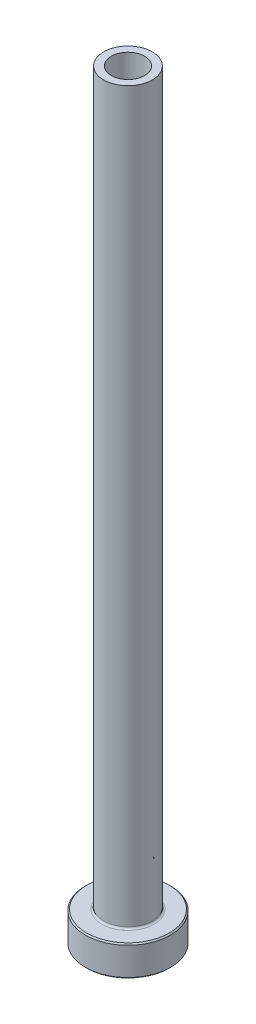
from build123d import *

# Parameters (mm, degrees)
FILLET1_R     = 0.3
CHAMFER1_SIZE = 0.2
CHAMFER3_SIZE = 0.5


with BuildPart() as part:
    # Sketch1 → Revolve1 (revolve)
    with BuildSketch(Plane.XY, mode=Mode.PRIVATE) as revolve1_sk:
        Polygon((-2.75, 125), (-4, 125), (-4, 5), (-7, 5), (-7, 0), (-3, 0), (-3, 68), (-2.75, 80), align=None)
    revolve(revolve1_sk.sketch.rotate(Axis((0, 92.187680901, 0), (0, -1, 0)), 270), axis=Axis((0, 92.187680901, 0), (0, -1, 0)))

    # Fillet1
    fillet1_edges = [part.edges().sort_by_distance(p)[0] for p in [
        (0, 5, -4),
    ]]
    fillet(fillet1_edges, radius=FILLET1_R)

    # Chamfer1
    chamfer1_edges = [part.edges().sort_by_distance(p)[0] for p in [
        (0, 0, -7),
        (0, 5, -7),
    ]]
    chamfer(chamfer1_edges, length=CHAMFER1_SIZE)

    # Chamfer3
    chamfer3_edges = [part.edges().sort_by_distance(p)[0] for p in [
        (0, 0, -3),
    ]]
    chamfer(chamfer3_edges, length=CHAMFER3_SIZE)


solid = part.part
